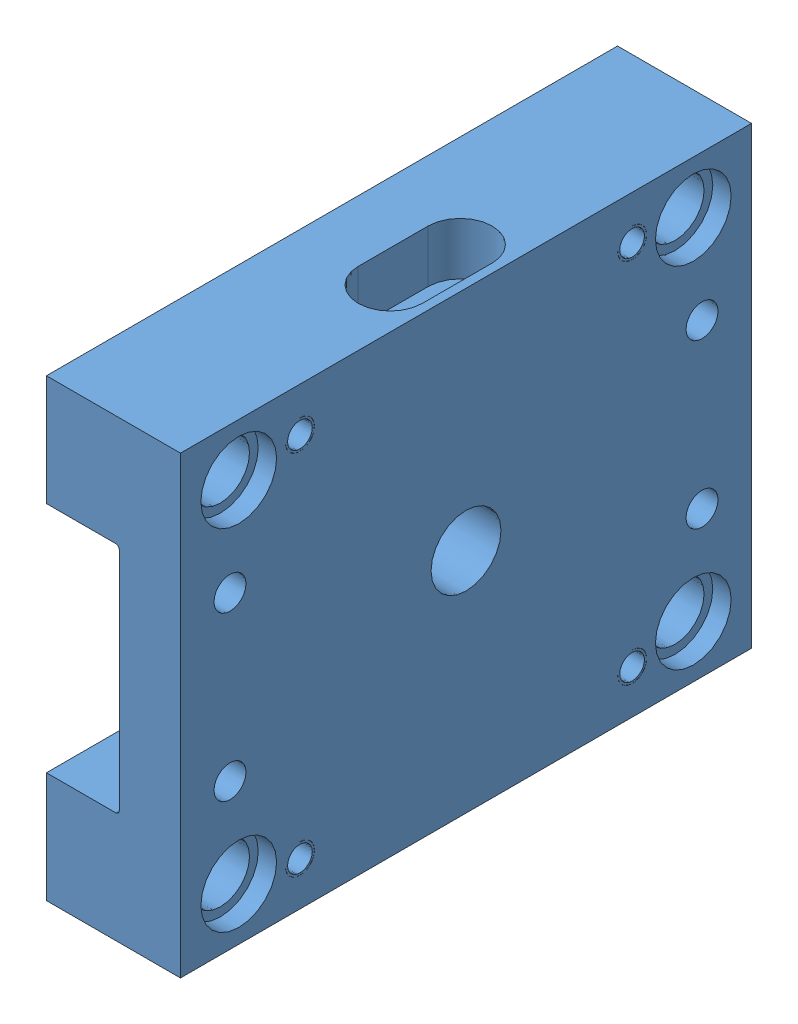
SolidWorks assembly Assemblage CORRECTION.SLDASM, configuration Défaut (file format 11000). Lengths in mm.
Overall size (46 156 196).
3 component instances, 3 part files, 6 mates.
Components (placement in the parent):
- Plaque porte empreinte-1: Plaque porte empreinte.SLDPRT [Défaut] at (-93.2456 13.8073 189.3215) size (46 156 196)
- plaque standard hasco CORRECTION-1: plaque standard hasco CORRECTION.SLDPRT [Défaut] at (-68.2456 13.8073 189.3215) x (1 0 0) z (0 1 0) size (25 140 80)
- Plaque engrenage-1: Plaque engrenage.SLDPRT [Défaut] at (-88.7456 13.8073 189.3215) x (0 1 0) z (-1 0 0) size (80 80 3)
Mates (geometry in assembly coordinates):
- Coïncidente2: coincident: plane of Plaque porte empreinte-1 through (-68.2456 -26.1927 91.3215) normal (-1 0 0); plane of plaque standard hasco CORRECTION-1 through (-68.2456 13.8073 189.3215) normal (1 0 0)
- Coaxiale1: concentric: cylinder of Plaque porte empreinte-1 through (-68.2456 -1.6927 251.3215) axis (-1 0 0) radius 2.5; cylinder of plaque standard hasco CORRECTION-1 through (-80.7456 -1.6927 251.3215) axis (1 0 0) radius 3.375
- Coïncidente3: coincident: plane of Plaque porte empreinte-1 through (-93.2456 -26.1927 91.3215) normal (0 1 0); plane of plaque standard hasco CORRECTION-1 through (-68.2456 -26.1927 259.3215) normal (0 -1 0)
- Coïncidente4: coincident: plane of plaque standard hasco CORRECTION-1 through (-88.7456 -26.1927 229.3215) normal (-1 0 0); plane of Plaque engrenage-1 through (-88.7456 -26.1927 229.3215) normal (1 0 0)
- Coaxiale3: concentric: cylinder of plaque standard hasco CORRECTION-1 through (-88.7456 47.8073 219.3215) axis (-1 0 0) radius 1.25; cylinder of Plaque engrenage-1 through (-88.7456 47.8073 219.3215) axis (-1 0 0) radius 1.5
- Coïncidente6: coincident: plane of Plaque porte empreinte-1 through (-68.2456 53.8073 91.3215) normal (0 -1 0); plane of Plaque engrenage-1 through (-91.7456 53.8073 149.3215) normal (0 1 0)
